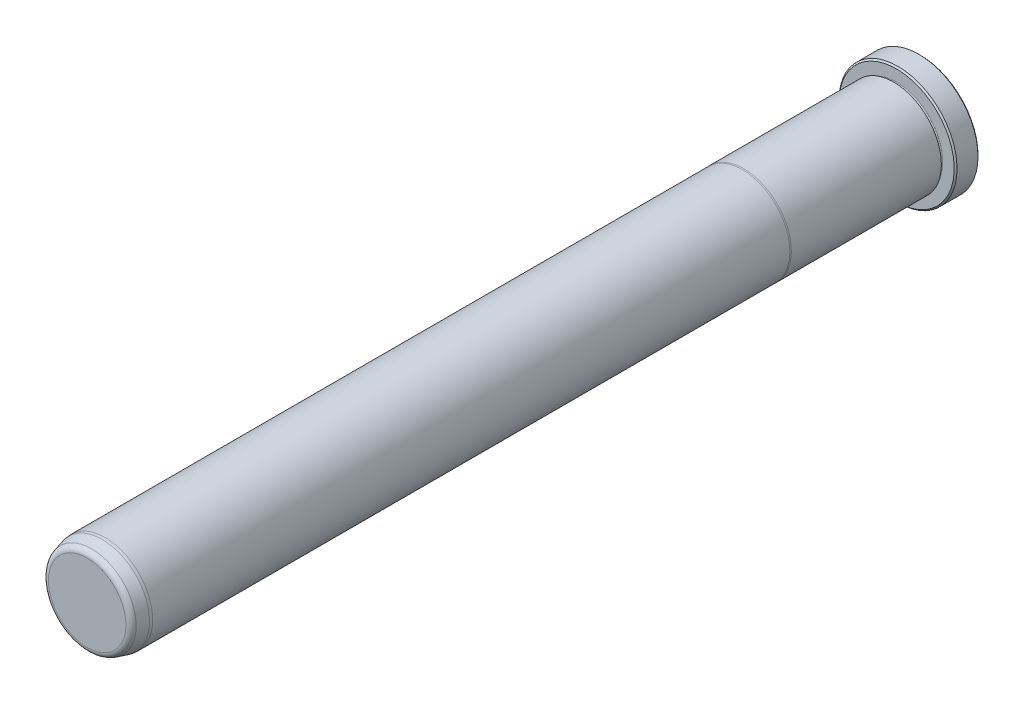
from build123d import *

# Parameters (mm, degrees)
FILLET6_R     = 1.5875
CHAMFER1_SIZE = 0.381


with BuildPart() as part:
    # Sketch1 → Revolve1 (revolve)
    with BuildSketch(Plane(origin=(0, 0, 0), x_dir=(0, 0, -1), z_dir=(1, 0, 0)), mode=Mode.PRIVATE) as revolve1_sk:
        with BuildLine():
            Line((0, 0), (0, 15.748))
            Line((0, 15.748), (-6.35, 15.748))
            Line((-6.35, 15.748), (-6.35, 12.3063))
            ThreePointArc((-6.35, 12.3063), (-6.731, 11.9253), (-7.112, 12.3063))
            Line((-7.112, 12.3063), (-7.112, 12.7127))
            Line((-7.112, 12.7127), (-47.134763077, 12.7127))
            Line((-47.134763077, 12.7127), (-47.498, 12.6873))
            Line((-47.498, 12.6873), (-217.4875, 12.6873))
            Line((-217.4875, 12.6873), (-218.2495, 12.620633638))
            Line((-218.2495, 12.620633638), (-222.25, 11.548702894))
            Line((-222.25, 11.548702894), (-222.25, 0))
            Line((-222.25, 0), (0, 0))
        make_face()
    revolve(revolve1_sk.sketch.rotate(Axis((0, 0, 0), (0, 0, -1)), 90), axis=Axis((0, 0, 0), (0, 0, -1)))

    # Fillet6
    fillet6_edges = [part.edges().sort_by_distance(p)[0] for p in [
        (-11.548702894, 0, 222.25),
    ]]
    fillet(fillet6_edges, radius=FILLET6_R)

    # Chamfer1
    chamfer1_edges = [part.edges().sort_by_distance(p)[0] for p in [
        (-15.748, 0, 6.35),
        (-15.748, 0, 0),
    ]]
    chamfer(chamfer1_edges, length=CHAMFER1_SIZE)


solid = part.part
